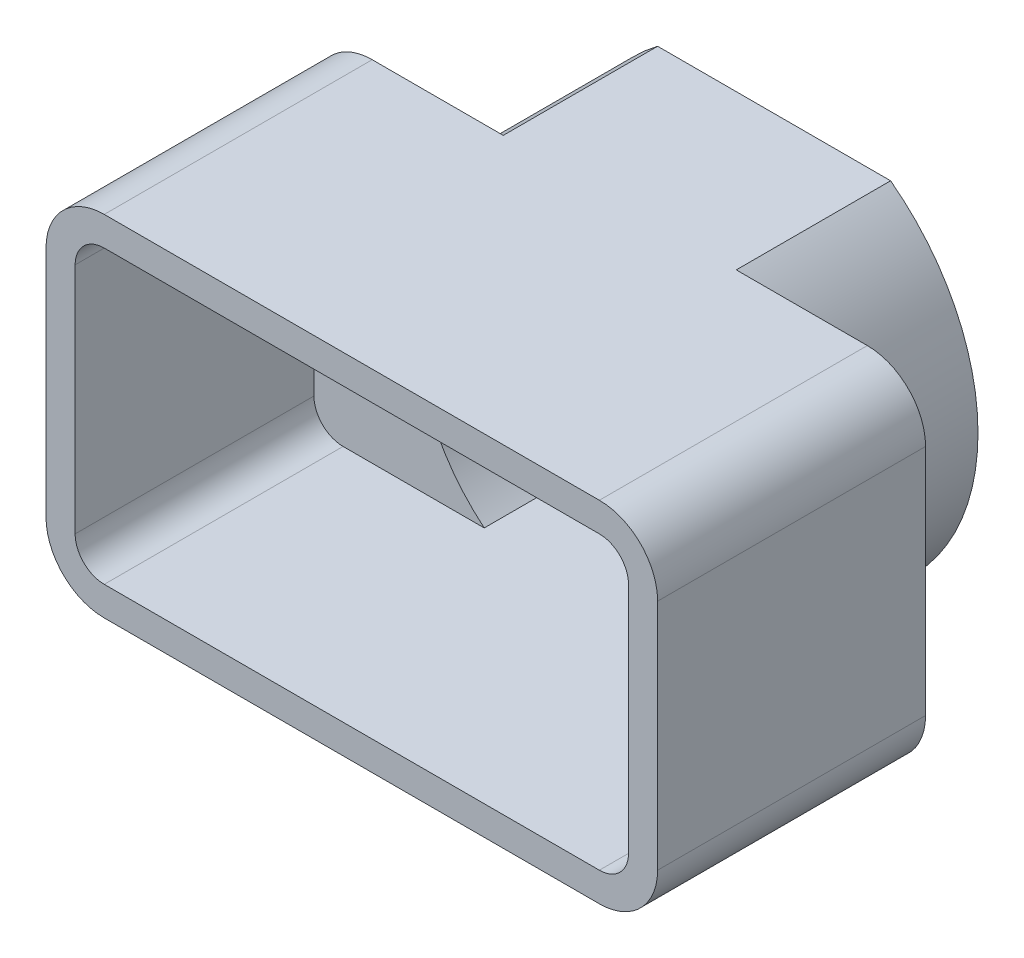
from build123d import *

# Parameters (mm, degrees)
BOSS_EXTRU_1_DEPTH      = 5.3
BOSS_EXTRU_2_DEPTH      = 9.2
ENL_V_MAT_EXTRU_1_DEPTH = 8.2
ESQUISSE6_R             = 1
BOSS_EXTRU_3_DEPTH      = 1


with BuildPart() as part:
    # Esquisse1 → Boss.-Extru.1 (new body)
    with BuildSketch(Plane.XY):
        with BuildLine():
            Line((4, 6), (-4, 6))
            ThreePointArc((-4, 6), (-7, 0), (-4, -6))
            Line((-4, -6), (4, -6))
            ThreePointArc((4, -6), (7, 0), (4, 6))
        make_face()
        with BuildLine():
            Line((3.653311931, 5), (-3.653311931, 5))
            ThreePointArc((-3.653311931, 5), (-6, 0), (-3.653311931, -5))
            Line((-3.653311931, -5), (3.653311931, -5))
            ThreePointArc((3.653311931, -5), (6, 0), (3.653311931, 5))
        make_face(mode=Mode.SUBTRACT)
    extrude(amount=BOSS_EXTRU_1_DEPTH)

    # Esquisse2 → Boss.-Extru.2 (add)
    with BuildSketch(Plane.XY.offset(5.3)):
        with BuildLine():
            Line((-8.5, -6), (8.5, -6))
            ThreePointArc((8.5, -6), (9.914213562, -5.414213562), (10.5, -4))
            Line((10.5, -4), (10.5, 4))
            ThreePointArc((10.5, 4), (9.914213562, 5.414213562), (8.5, 6))
            Line((8.5, 6), (-8.5, 6))
            ThreePointArc((-8.5, 6), (-9.914213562, 5.414213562), (-10.5, 4))
            Line((-10.5, 4), (-10.5, -4))
            ThreePointArc((-10.5, -4), (-9.914213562, -5.414213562), (-8.5, -6))
        make_face()
        with BuildLine():
            Line((-3.653311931, 5), (3.653311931, 5))
            ThreePointArc((3.653311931, 5), (6, 0), (3.653311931, -5))
            Line((3.653311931, -5), (-3.653311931, -5))
            ThreePointArc((-3.653311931, -5), (-6, 0), (-3.653311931, 5))
        make_face(mode=Mode.SUBTRACT)
    extrude(amount=BOSS_EXTRU_2_DEPTH)

    # Esquisse3 → Enl_v. mat.-Extru.1 (cut)
    with BuildSketch(Plane.XY.offset(14.5)):
        with BuildLine():
            Line((-8.5, -5), (8.5, -5))
            ThreePointArc((8.5, -5), (9.207106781, -4.707106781), (9.5, -4))
            Line((9.5, -4), (9.5, 4))
            ThreePointArc((9.5, 4), (9.207106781, 4.707106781), (8.5, 5))
            Line((8.5, 5), (-8.5, 5))
            ThreePointArc((-8.5, 5), (-9.207106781, 4.707106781), (-9.5, 4))
            Line((-9.5, 4), (-9.5, -4))
            ThreePointArc((-9.5, -4), (-9.207106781, -4.707106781), (-8.5, -5))
        make_face()
    extrude(amount=-ENL_V_MAT_EXTRU_1_DEPTH, mode=Mode.SUBTRACT)

    # Esquisse6 → Boss.-Extru.3 (add)
    with BuildSketch(Plane(origin=(0, 0, 0), x_dir=(-1, 0, 0), z_dir=(0, 0, -1))):
        with BuildLine():
            Line((-4, 6), (4, 6))
            ThreePointArc((4, 6), (7, 0), (4, -6))
            Line((4, -6), (-4, -6))
            ThreePointArc((-4, -6), (-7, 0), (-4, 6))
        make_face()
        Circle(ESQUISSE6_R, mode=Mode.SUBTRACT)
    extrude(amount=-BOSS_EXTRU_3_DEPTH)


solid = part.part
